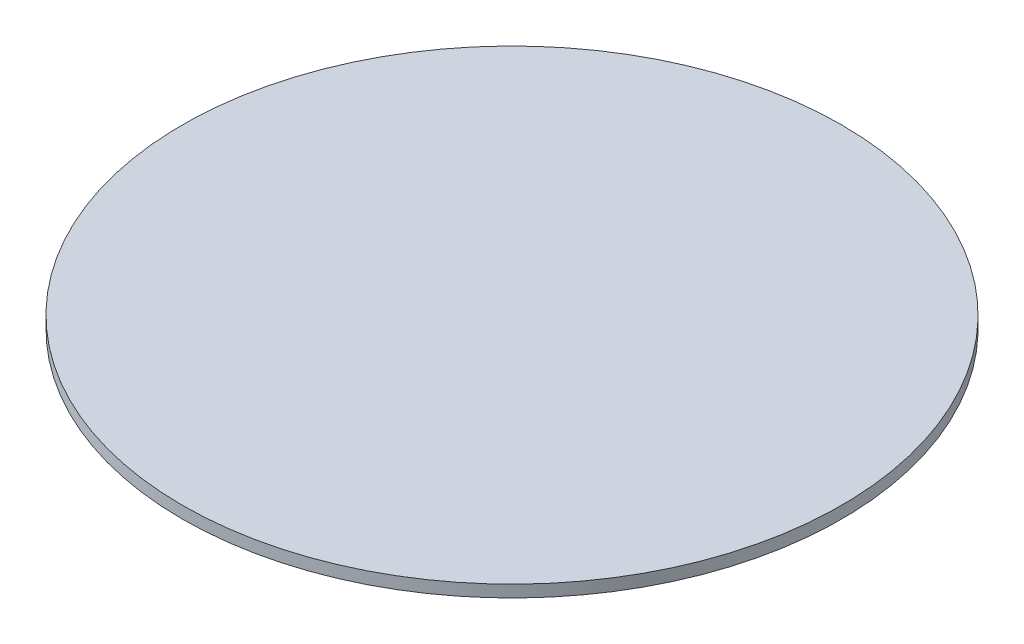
ISO-10303-21;
HEADER;
FILE_DESCRIPTION(('STEP AP214'),'2;1');
FILE_NAME('part.step','',(''),(''),'','','');
FILE_SCHEMA(('AUTOMOTIVE_DESIGN { 1 0 10303 214 1 1 1 1 }'));
ENDSEC;
DATA;
#1=APPLICATION_CONTEXT('core data for automotive mechanical design processes');
#2=APPLICATION_PROTOCOL_DEFINITION('international standard','automotive_design',2000,#1);
#3=PRODUCT_CONTEXT('',#1,'mechanical');
#4=PRODUCT('Part','Part','',(#3));
#5=PRODUCT_RELATED_PRODUCT_CATEGORY('part','',(#4));
#6=PRODUCT_DEFINITION_FORMATION('','',#4);
#7=PRODUCT_DEFINITION_CONTEXT('part definition',#1,'design');
#8=PRODUCT_DEFINITION('design','',#6,#7);
#9=PRODUCT_DEFINITION_SHAPE('','',#8);
#10=(LENGTH_UNIT() NAMED_UNIT(*) SI_UNIT(.MILLI.,.METRE.));
#11=(NAMED_UNIT(*) PLANE_ANGLE_UNIT() SI_UNIT($,.RADIAN.));
#12=(NAMED_UNIT(*) SI_UNIT($,.STERADIAN.) SOLID_ANGLE_UNIT());
#13=UNCERTAINTY_MEASURE_WITH_UNIT(LENGTH_MEASURE(1.E-05),#10,'distance_accuracy_value','');
#14=(GEOMETRIC_REPRESENTATION_CONTEXT(3) GLOBAL_UNCERTAINTY_ASSIGNED_CONTEXT((#13)) GLOBAL_UNIT_ASSIGNED_CONTEXT((#10,
#11,#12)) REPRESENTATION_CONTEXT('',''));
#15=CARTESIAN_POINT('',(0.,0.,0.));
#16=DIRECTION('',(0.,0.,1.));
#17=DIRECTION('',(1.,0.,0.));
#18=AXIS2_PLACEMENT_3D('',#15,#16,#17);
#19=CARTESIAN_POINT('',(0.,0.,0.));
#20=DIRECTION('',(0.,1.,0.));
#21=DIRECTION('',(0.,0.,1.));
#22=AXIS2_PLACEMENT_3D('',#19,#20,#21);
#23=PLANE('',#22);
#24=CARTESIAN_POINT('',(0.,0.,0.));
#25=DIRECTION('',(0.,1.,0.));
#26=DIRECTION('',(0.,0.,1.));
#27=AXIS2_PLACEMENT_3D('',#24,#25,#26);
#28=CIRCLE('',#27,257.175);
#29=CARTESIAN_POINT('',(0.,0.,257.175));
#30=VERTEX_POINT('',#29);
#31=EDGE_CURVE('E10',#30,#30,#28,.T.);
#32=ORIENTED_EDGE('',*,*,#31,.F.);
#33=EDGE_LOOP('',(#32));
#34=FACE_BOUND('',#33,.T.);
#35=ADVANCED_FACE('F34',(#34),#23,.F.);
#36=CARTESIAN_POINT('',(0.,4.7625,0.));
#37=DIRECTION('',(0.,1.,0.));
#38=DIRECTION('',(0.,0.,1.));
#39=AXIS2_PLACEMENT_3D('',#36,#37,#38);
#40=CYLINDRICAL_SURFACE('',#39,257.175);
#41=CARTESIAN_POINT('',(0.,-4.76249999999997,0.));
#42=DIRECTION('',(0.,1.,0.));
#43=DIRECTION('',(0.,0.,1.));
#44=AXIS2_PLACEMENT_3D('',#41,#42,#43);
#45=CIRCLE('',#44,257.175);
#46=CARTESIAN_POINT('',(0.,-4.76249999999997,257.175));
#47=VERTEX_POINT('',#46);
#48=EDGE_CURVE('E40',#47,#47,#45,.T.);
#49=ORIENTED_EDGE('',*,*,#48,.F.);
#50=EDGE_LOOP('',(#49));
#51=FACE_BOUND('',#50,.T.);
#52=ORIENTED_EDGE('',*,*,#31,.T.);
#53=EDGE_LOOP('',(#52));
#54=FACE_BOUND('',#53,.T.);
#55=ADVANCED_FACE('F64',(#51,#54),#40,.F.);
#56=CARTESIAN_POINT('',(257.175,-4.76249999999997,0.));
#57=DIRECTION('',(0.,1.,0.));
#58=DIRECTION('',(0.,0.,1.));
#59=AXIS2_PLACEMENT_3D('',#56,#57,#58);
#60=PLANE('',#59);
#61=CARTESIAN_POINT('',(0.,-4.76249999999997,0.));
#62=DIRECTION('',(0.,1.,0.));
#63=DIRECTION('',(0.,0.,1.));
#64=AXIS2_PLACEMENT_3D('',#61,#62,#63);
#65=CIRCLE('',#64,261.9375);
#66=CARTESIAN_POINT('',(0.,-4.76249999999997,261.9375));
#67=VERTEX_POINT('',#66);
#68=EDGE_CURVE('E44',#67,#67,#65,.T.);
#69=ORIENTED_EDGE('',*,*,#68,.F.);
#70=EDGE_LOOP('',(#69));
#71=FACE_BOUND('',#70,.T.);
#72=ORIENTED_EDGE('',*,*,#48,.T.);
#73=EDGE_LOOP('',(#72));
#74=FACE_BOUND('',#73,.T.);
#75=ADVANCED_FACE('F59',(#71,#74),#60,.F.);
#76=CARTESIAN_POINT('',(0.,4.7625,0.));
#77=DIRECTION('',(0.,1.,0.));
#78=DIRECTION('',(0.,0.,1.));
#79=AXIS2_PLACEMENT_3D('',#76,#77,#78);
#80=CYLINDRICAL_SURFACE('',#79,261.9375);
#81=CARTESIAN_POINT('',(0.,4.76250000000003,0.));
#82=DIRECTION('',(0.,1.,0.));
#83=DIRECTION('',(0.,0.,1.));
#84=AXIS2_PLACEMENT_3D('',#81,#82,#83);
#85=CIRCLE('',#84,261.9375);
#86=CARTESIAN_POINT('',(0.,4.76250000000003,261.9375));
#87=VERTEX_POINT('',#86);
#88=EDGE_CURVE('E48',#87,#87,#85,.T.);
#89=ORIENTED_EDGE('',*,*,#88,.F.);
#90=EDGE_LOOP('',(#89));
#91=FACE_BOUND('',#90,.T.);
#92=ORIENTED_EDGE('',*,*,#68,.T.);
#93=EDGE_LOOP('',(#92));
#94=FACE_BOUND('',#93,.T.);
#95=ADVANCED_FACE('F56',(#91,#94),#80,.T.);
#96=CARTESIAN_POINT('',(261.9375,4.76250000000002,0.));
#97=DIRECTION('',(0.,-1.,0.));
#98=DIRECTION('',(0.,0.,-1.));
#99=AXIS2_PLACEMENT_3D('',#96,#97,#98);
#100=PLANE('',#99);
#101=ORIENTED_EDGE('',*,*,#88,.T.);
#102=EDGE_LOOP('',(#101));
#103=FACE_BOUND('',#102,.T.);
#104=ADVANCED_FACE('F54',(#103),#100,.F.);
#105=CLOSED_SHELL('',(#35,#55,#75,#95,#104));
#106=MANIFOLD_SOLID_BREP('B2',#105);
#107=ADVANCED_BREP_SHAPE_REPRESENTATION('',(#18,#106),#14);
#108=SHAPE_DEFINITION_REPRESENTATION(#9,#107);
ENDSEC;
END-ISO-10303-21;
